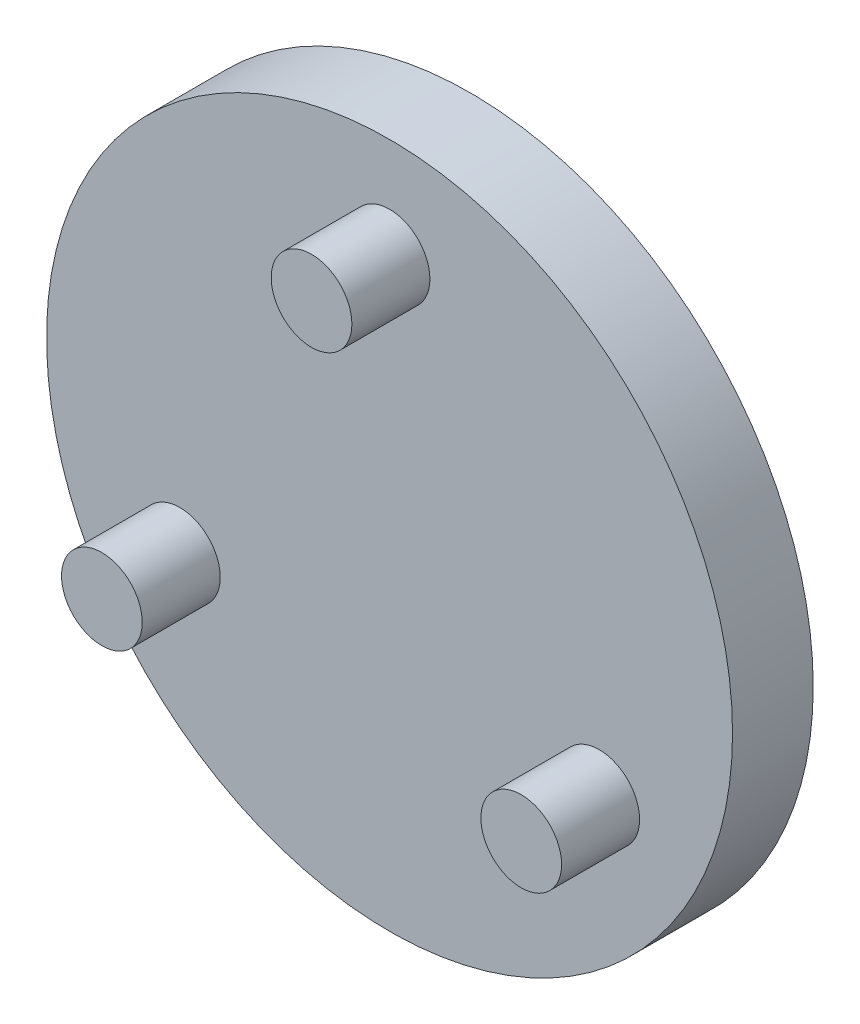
ISO-10303-21;
HEADER;
FILE_DESCRIPTION(('STEP AP214'),'2;1');
FILE_NAME('part.step','',(''),(''),'','','');
FILE_SCHEMA(('AUTOMOTIVE_DESIGN { 1 0 10303 214 1 1 1 1 }'));
ENDSEC;
DATA;
#1=APPLICATION_CONTEXT('core data for automotive mechanical design processes');
#2=APPLICATION_PROTOCOL_DEFINITION('international standard','automotive_design',2000,#1);
#3=PRODUCT_CONTEXT('',#1,'mechanical');
#4=PRODUCT('Part','Part','',(#3));
#5=PRODUCT_RELATED_PRODUCT_CATEGORY('part','',(#4));
#6=PRODUCT_DEFINITION_FORMATION('','',#4);
#7=PRODUCT_DEFINITION_CONTEXT('part definition',#1,'design');
#8=PRODUCT_DEFINITION('design','',#6,#7);
#9=PRODUCT_DEFINITION_SHAPE('','',#8);
#10=(LENGTH_UNIT() NAMED_UNIT(*) SI_UNIT(.MILLI.,.METRE.));
#11=(NAMED_UNIT(*) PLANE_ANGLE_UNIT() SI_UNIT($,.RADIAN.));
#12=(NAMED_UNIT(*) SI_UNIT($,.STERADIAN.) SOLID_ANGLE_UNIT());
#13=UNCERTAINTY_MEASURE_WITH_UNIT(LENGTH_MEASURE(1.E-05),#10,'distance_accuracy_value','');
#14=(GEOMETRIC_REPRESENTATION_CONTEXT(3) GLOBAL_UNCERTAINTY_ASSIGNED_CONTEXT((#13)) GLOBAL_UNIT_ASSIGNED_CONTEXT((#10,
#11,#12)) REPRESENTATION_CONTEXT('',''));
#15=CARTESIAN_POINT('',(0.,0.,0.));
#16=DIRECTION('',(0.,0.,1.));
#17=DIRECTION('',(1.,0.,0.));
#18=AXIS2_PLACEMENT_3D('',#15,#16,#17);
#19=CARTESIAN_POINT('',(0.,0.,0.));
#20=DIRECTION('',(0.,0.,1.));
#21=DIRECTION('',(1.,0.,0.));
#22=AXIS2_PLACEMENT_3D('',#19,#20,#21);
#23=PLANE('',#22);
#24=CARTESIAN_POINT('',(0.,0.,0.));
#25=DIRECTION('',(0.,0.,1.));
#26=DIRECTION('',(1.,0.,0.));
#27=AXIS2_PLACEMENT_3D('',#24,#25,#26);
#28=CIRCLE('',#27,12.75);
#29=CARTESIAN_POINT('',(12.75,0.,0.));
#30=VERTEX_POINT('',#29);
#31=EDGE_CURVE('E39',#30,#30,#28,.T.);
#32=ORIENTED_EDGE('',*,*,#31,.F.);
#33=EDGE_LOOP('',(#32));
#34=FACE_BOUND('',#33,.T.);
#35=CARTESIAN_POINT('',(0.,0.,0.));
#36=DIRECTION('',(0.,0.,1.));
#37=DIRECTION('',(1.,0.,0.));
#38=AXIS2_PLACEMENT_3D('',#35,#36,#37);
#39=CIRCLE('',#38,1.5);
#40=CARTESIAN_POINT('',(1.5,0.,0.));
#41=VERTEX_POINT('',#40);
#42=EDGE_CURVE('E10',#41,#41,#39,.F.);
#43=ORIENTED_EDGE('',*,*,#42,.F.);
#44=EDGE_LOOP('',(#43));
#45=FACE_BOUND('',#44,.T.);
#46=ADVANCED_FACE('F28',(#34,#45),#23,.F.);
#47=CARTESIAN_POINT('',(0.,0.,3.));
#48=DIRECTION('',(0.,0.,1.));
#49=DIRECTION('',(1.,0.,0.));
#50=AXIS2_PLACEMENT_3D('',#47,#48,#49);
#51=PLANE('',#50);
#52=CARTESIAN_POINT('',(7.79422863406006,-4.49999999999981,3.));
#53=DIRECTION('',(0.,0.,1.));
#54=DIRECTION('',(1.,0.,0.));
#55=AXIS2_PLACEMENT_3D('',#52,#53,#54);
#56=CIRCLE('',#55,1.50000000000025);
#57=CARTESIAN_POINT('',(9.29422863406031,-4.49999999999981,3.));
#58=VERTEX_POINT('',#57);
#59=EDGE_CURVE('E54',#58,#58,#56,.T.);
#60=ORIENTED_EDGE('',*,*,#59,.F.);
#61=EDGE_LOOP('',(#60));
#62=FACE_BOUND('',#61,.T.);
#63=CARTESIAN_POINT('',(0.,0.,3.));
#64=DIRECTION('',(0.,0.,1.));
#65=DIRECTION('',(1.,0.,0.));
#66=AXIS2_PLACEMENT_3D('',#63,#64,#65);
#67=CIRCLE('',#66,12.75);
#68=CARTESIAN_POINT('',(12.75,0.,3.));
#69=VERTEX_POINT('',#68);
#70=EDGE_CURVE('E35',#69,#69,#67,.T.);
#71=ORIENTED_EDGE('',*,*,#70,.T.);
#72=EDGE_LOOP('',(#71));
#73=FACE_BOUND('',#72,.T.);
#74=CARTESIAN_POINT('',(0.,9.,3.));
#75=DIRECTION('',(0.,0.,1.));
#76=DIRECTION('',(1.,0.,0.));
#77=AXIS2_PLACEMENT_3D('',#74,#75,#76);
#78=CIRCLE('',#77,1.5);
#79=CARTESIAN_POINT('',(1.5,9.,3.));
#80=VERTEX_POINT('',#79);
#81=EDGE_CURVE('E48',#80,#80,#78,.T.);
#82=ORIENTED_EDGE('',*,*,#81,.F.);
#83=EDGE_LOOP('',(#82));
#84=FACE_BOUND('',#83,.T.);
#85=CARTESIAN_POINT('',(-7.79422863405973,-4.5,3.));
#86=DIRECTION('',(0.,0.,1.));
#87=DIRECTION('',(1.,0.,0.));
#88=AXIS2_PLACEMENT_3D('',#85,#86,#87);
#89=CIRCLE('',#88,1.50000000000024);
#90=CARTESIAN_POINT('',(-6.29422863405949,-4.5,3.));
#91=VERTEX_POINT('',#90);
#92=EDGE_CURVE('E60',#91,#91,#89,.T.);
#93=ORIENTED_EDGE('',*,*,#92,.F.);
#94=EDGE_LOOP('',(#93));
#95=FACE_BOUND('',#94,.T.);
#96=ADVANCED_FACE('F82',(#62,#73,#84,#95),#51,.T.);
#97=CARTESIAN_POINT('',(0.,0.,3.));
#98=DIRECTION('',(0.,0.,-1.));
#99=DIRECTION('',(-1.,0.,0.));
#100=AXIS2_PLACEMENT_3D('',#97,#98,#99);
#101=CYLINDRICAL_SURFACE('',#100,12.75);
#102=ORIENTED_EDGE('',*,*,#70,.F.);
#103=EDGE_LOOP('',(#102));
#104=FACE_BOUND('',#103,.T.);
#105=ORIENTED_EDGE('',*,*,#31,.T.);
#106=EDGE_LOOP('',(#105));
#107=FACE_BOUND('',#106,.T.);
#108=ADVANCED_FACE('F30',(#104,#107),#101,.T.);
#109=CARTESIAN_POINT('',(0.,9.,5.9));
#110=DIRECTION('',(0.,0.,-1.));
#111=DIRECTION('',(-1.,0.,0.));
#112=AXIS2_PLACEMENT_3D('',#109,#110,#111);
#113=CYLINDRICAL_SURFACE('',#112,1.5);
#114=CARTESIAN_POINT('',(0.,9.,5.9));
#115=DIRECTION('',(0.,0.,1.));
#116=DIRECTION('',(1.,0.,0.));
#117=AXIS2_PLACEMENT_3D('',#114,#115,#116);
#118=CIRCLE('',#117,1.5);
#119=CARTESIAN_POINT('',(1.5,9.,5.9));
#120=VERTEX_POINT('',#119);
#121=EDGE_CURVE('E43',#120,#120,#118,.T.);
#122=ORIENTED_EDGE('',*,*,#121,.F.);
#123=EDGE_LOOP('',(#122));
#124=FACE_BOUND('',#123,.T.);
#125=ORIENTED_EDGE('',*,*,#81,.T.);
#126=EDGE_LOOP('',(#125));
#127=FACE_BOUND('',#126,.T.);
#128=ADVANCED_FACE('F92',(#124,#127),#113,.T.);
#129=CARTESIAN_POINT('',(0.,9.,5.9));
#130=DIRECTION('',(0.,0.,1.));
#131=DIRECTION('',(1.,0.,0.));
#132=AXIS2_PLACEMENT_3D('',#129,#130,#131);
#133=PLANE('',#132);
#134=ORIENTED_EDGE('',*,*,#121,.T.);
#135=EDGE_LOOP('',(#134));
#136=FACE_BOUND('',#135,.T.);
#137=ADVANCED_FACE('F95',(#136),#133,.T.);
#138=CARTESIAN_POINT('',(7.79422863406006,-4.49999999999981,5.9));
#139=DIRECTION('',(0.,0.,-1.));
#140=DIRECTION('',(-1.,0.,0.));
#141=AXIS2_PLACEMENT_3D('',#138,#139,#140);
#142=CYLINDRICAL_SURFACE('',#141,1.50000000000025);
#143=CARTESIAN_POINT('',(7.79422863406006,-4.49999999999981,5.9));
#144=DIRECTION('',(0.,0.,1.));
#145=DIRECTION('',(1.,0.,0.));
#146=AXIS2_PLACEMENT_3D('',#143,#144,#145);
#147=CIRCLE('',#146,1.50000000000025);
#148=CARTESIAN_POINT('',(9.29422863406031,-4.49999999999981,5.9));
#149=VERTEX_POINT('',#148);
#150=EDGE_CURVE('E51',#149,#149,#147,.T.);
#151=ORIENTED_EDGE('',*,*,#150,.F.);
#152=EDGE_LOOP('',(#151));
#153=FACE_BOUND('',#152,.T.);
#154=ORIENTED_EDGE('',*,*,#59,.T.);
#155=EDGE_LOOP('',(#154));
#156=FACE_BOUND('',#155,.T.);
#157=ADVANCED_FACE('F99',(#153,#156),#142,.T.);
#158=CARTESIAN_POINT('',(7.79422863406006,-4.49999999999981,5.9));
#159=DIRECTION('',(0.,0.,1.));
#160=DIRECTION('',(1.,0.,0.));
#161=AXIS2_PLACEMENT_3D('',#158,#159,#160);
#162=PLANE('',#161);
#163=ORIENTED_EDGE('',*,*,#150,.T.);
#164=EDGE_LOOP('',(#163));
#165=FACE_BOUND('',#164,.T.);
#166=ADVANCED_FACE('F103',(#165),#162,.T.);
#167=CARTESIAN_POINT('',(-7.79422863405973,-4.5,5.9));
#168=DIRECTION('',(0.,0.,-1.));
#169=DIRECTION('',(-1.,0.,0.));
#170=AXIS2_PLACEMENT_3D('',#167,#168,#169);
#171=CYLINDRICAL_SURFACE('',#170,1.50000000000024);
#172=CARTESIAN_POINT('',(-7.79422863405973,-4.5,5.9));
#173=DIRECTION('',(0.,0.,1.));
#174=DIRECTION('',(1.,0.,0.));
#175=AXIS2_PLACEMENT_3D('',#172,#173,#174);
#176=CIRCLE('',#175,1.50000000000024);
#177=CARTESIAN_POINT('',(-6.29422863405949,-4.5,5.9));
#178=VERTEX_POINT('',#177);
#179=EDGE_CURVE('E57',#178,#178,#176,.T.);
#180=ORIENTED_EDGE('',*,*,#179,.F.);
#181=EDGE_LOOP('',(#180));
#182=FACE_BOUND('',#181,.T.);
#183=ORIENTED_EDGE('',*,*,#92,.T.);
#184=EDGE_LOOP('',(#183));
#185=FACE_BOUND('',#184,.T.);
#186=ADVANCED_FACE('F78',(#182,#185),#171,.T.);
#187=CARTESIAN_POINT('',(-7.79422863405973,-4.5,5.9));
#188=DIRECTION('',(0.,0.,1.));
#189=DIRECTION('',(1.,0.,0.));
#190=AXIS2_PLACEMENT_3D('',#187,#188,#189);
#191=PLANE('',#190);
#192=ORIENTED_EDGE('',*,*,#179,.T.);
#193=EDGE_LOOP('',(#192));
#194=FACE_BOUND('',#193,.T.);
#195=ADVANCED_FACE('F71',(#194),#191,.T.);
#196=CARTESIAN_POINT('',(0.,0.,-2.9));
#197=DIRECTION('',(0.,0.,1.));
#198=DIRECTION('',(1.,0.,0.));
#199=AXIS2_PLACEMENT_3D('',#196,#197,#198);
#200=CYLINDRICAL_SURFACE('',#199,1.5);
#201=CARTESIAN_POINT('',(0.,0.,-2.9));
#202=DIRECTION('',(0.,0.,-1.));
#203=DIRECTION('',(-1.,0.,0.));
#204=AXIS2_PLACEMENT_3D('',#201,#202,#203);
#205=CIRCLE('',#204,1.5);
#206=CARTESIAN_POINT('',(-1.5,0.,-2.9));
#207=VERTEX_POINT('',#206);
#208=EDGE_CURVE('E63',#207,#207,#205,.T.);
#209=ORIENTED_EDGE('',*,*,#208,.F.);
#210=EDGE_LOOP('',(#209));
#211=FACE_BOUND('',#210,.T.);
#212=ORIENTED_EDGE('',*,*,#42,.T.);
#213=EDGE_LOOP('',(#212));
#214=FACE_BOUND('',#213,.T.);
#215=ADVANCED_FACE('F69',(#211,#214),#200,.T.);
#216=CARTESIAN_POINT('',(0.,0.,-2.9));
#217=DIRECTION('',(0.,0.,-1.));
#218=DIRECTION('',(-1.,0.,0.));
#219=AXIS2_PLACEMENT_3D('',#216,#217,#218);
#220=PLANE('',#219);
#221=ORIENTED_EDGE('',*,*,#208,.T.);
#222=EDGE_LOOP('',(#221));
#223=FACE_BOUND('',#222,.T.);
#224=ADVANCED_FACE('F67',(#223),#220,.T.);
#225=CLOSED_SHELL('',(#46,#96,#108,#128,#137,#157,#166,#186,#195,#215,#224));
#226=MANIFOLD_SOLID_BREP('B2',#225);
#227=ADVANCED_BREP_SHAPE_REPRESENTATION('',(#18,#226),#14);
#228=SHAPE_DEFINITION_REPRESENTATION(#9,#227);
ENDSEC;
END-ISO-10303-21;
